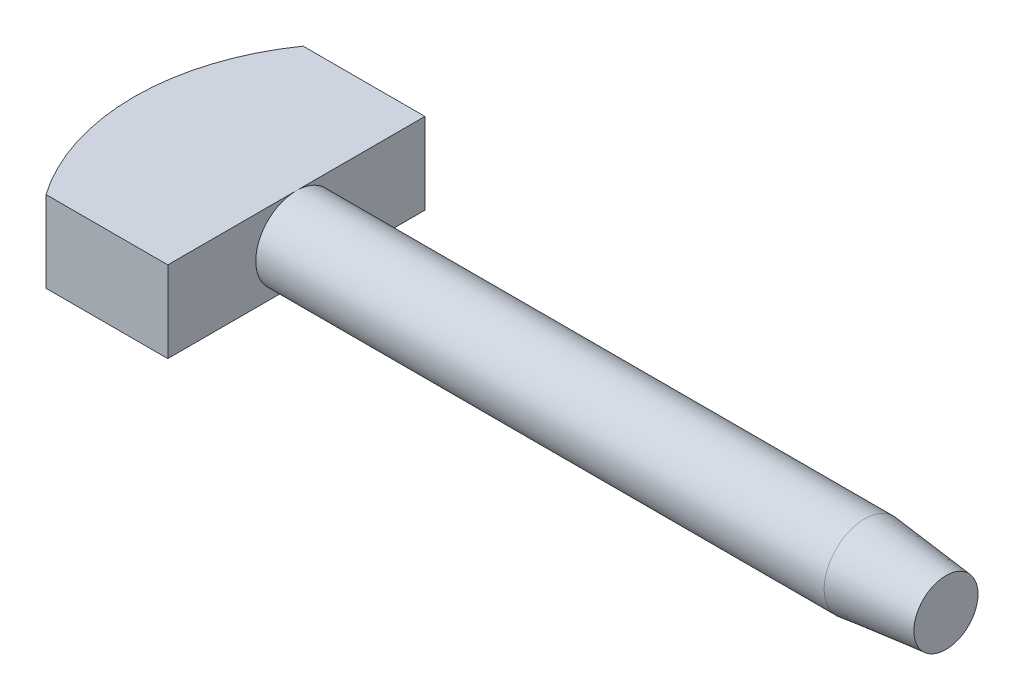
from build123d import *

# Parameters (mm, degrees)
ESQUISSE1_R             = 1.5
BOSS_EXTRU_1_DEPTH      = 24
CHANFREIN1_SIZE         = 3
CHANFREIN1_SIZE2        = 0.315312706
BOSS_EXTRU_3_DEPTH      = 1.5
BOSS_EXTRU_3_DEPTH_BACK = 1.5


with BuildPart() as part:
    # Esquisse1 → Boss.-Extru.1 (new body)
    with BuildSketch(Plane(origin=(0, 0, 0), x_dir=(0, 0, -1), z_dir=(1, 0, 0))):
        Circle(ESQUISSE1_R)
    extrude(amount=BOSS_EXTRU_1_DEPTH)

    # Chanfrein1
    chanfrein1_edges = [part.edges().sort_by_distance(p)[0] for p in [
        (24, 0, 1.5),
    ]]
    chanfrein1_side = [part.faces().sort_by_distance(p)[0] for p in [
        (12, 0, 1.5),
    ]]
    chamfer(chanfrein1_edges, length=CHANFREIN1_SIZE, length2=CHANFREIN1_SIZE2, reference=chanfrein1_side[0])

    # Esquisse2 → Boss.-Extru.3 (add, two sides: drawn at the far end of the back side and taken through both)
    with BuildSketch(Plane(origin=(0, 0, 0), x_dir=(1, 0, 0), z_dir=(0, 1, 0)).offset(-BOSS_EXTRU_3_DEPTH_BACK)):
        with BuildLine():
            Line((0, 4.75), (-4.5, 4.75))
            ThreePointArc((-4.5, 4.75), (-6, 0), (-4.5, -4.75))
            Line((-4.5, -4.75), (0, -4.75))
            Line((0, -4.75), (0, 4.75))
        make_face()
    extrude(amount=BOSS_EXTRU_3_DEPTH + BOSS_EXTRU_3_DEPTH_BACK)


solid = part.part
